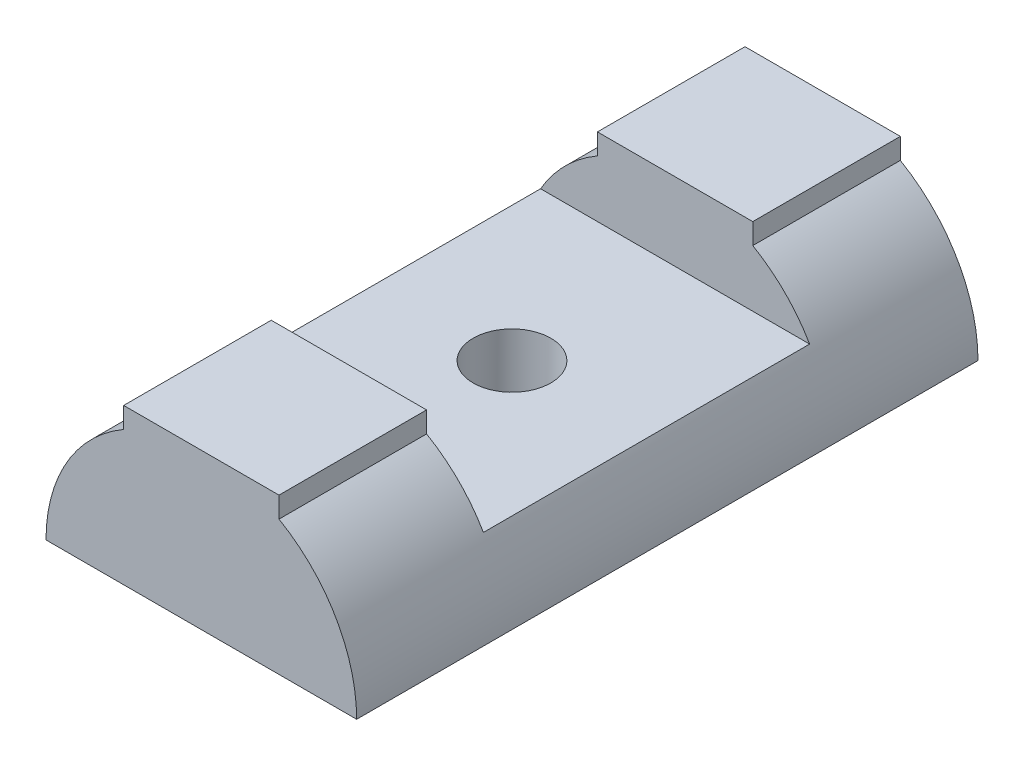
from build123d import *

# Parameters (mm, degrees)
SKETCH1_R           = 10
BOSS_EXTRUDE1_DEPTH = 20
SKETCH2_W           = 10
SKETCH2_H           = 20
BOSS_EXTRUDE2_DEPTH = 40
SKETCH3_W           = 17.320508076
SKETCH3_H           = 5
CUT_EXTRUDE1_DEPTH  = 10.5
SKETCH4_R           = 2.5
CUT_EXTRUDE2_DEPTH  = 27.925824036
SKETCH5_W           = 20
SKETCH5_H           = 10
CUT_EXTRUDE3_DEPTH  = 43.426406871


with BuildPart() as part:
    # Sketch1 → Boss-Extrude1 (new, symmetric)
    with BuildSketch(Plane.XY):
        Circle(SKETCH1_R)
    extrude(amount=BOSS_EXTRUDE1_DEPTH, both=True)

    # Sketch2 → Boss-Extrude2 (add)
    with BuildSketch(Plane.XY.offset(20)):
        Rectangle(SKETCH2_W, SKETCH2_H)
    extrude(amount=-BOSS_EXTRUDE2_DEPTH)

    # Sketch3 → Cut-Extrude1 (cut, symmetric)
    with BuildSketch(Plane.XY):
        with Locations((0, 7.5)):
            Rectangle(SKETCH3_W, SKETCH3_H)
    extrude(amount=CUT_EXTRUDE1_DEPTH, both=True, mode=Mode.SUBTRACT)

    # Sketch4 → Cut-Extrude2 (cut, through all)
    with BuildSketch(Plane(origin=(0, 5, 0), x_dir=(1, 0, 0), z_dir=(0, 1, 0))):
        with Locations(Location((0, 0, 0), (0, 0, 270))):
            Circle(SKETCH4_R)
    extrude(amount=-CUT_EXTRUDE2_DEPTH, mode=Mode.SUBTRACT)

    # Sketch5 → Cut-Extrude3 (cut, through all)
    with BuildSketch(Plane.XY.offset(20)):
        with Locations((0, -5)):
            Rectangle(SKETCH5_W, SKETCH5_H)
    extrude(amount=-CUT_EXTRUDE3_DEPTH, mode=Mode.SUBTRACT)


solid = part.part
